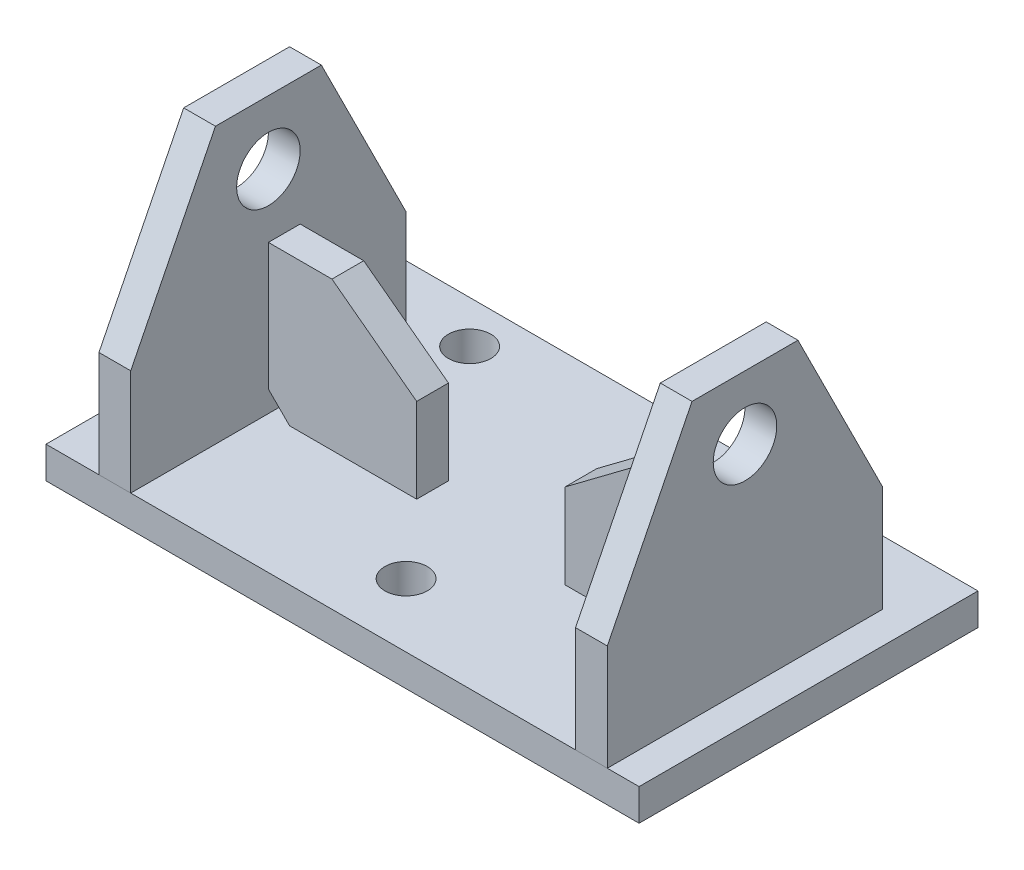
from build123d import *

# Parameters (mm, degrees)
SKETCH1_W      = 177.8
SKETCH1_H      = 101.6
PLATE_DEPTH    = 9.525
SKETCH2_R      = 6.35
HOLES_DEPTH    = 103.832755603
SKETCH3_R      = 9.525
EXTRUDE1_DEPTH = 9.525
EXTRUDE2_DEPTH = 9.525
CHAMFER1_SIZE  = 6.35


with BuildPart() as part:
    # Sketch1 → Plate (new body)
    with BuildSketch(Plane(origin=(0, 0, 0), x_dir=(1, 0, 0), z_dir=(0, 1, 0))):
        Rectangle(SKETCH1_W, SKETCH1_H)
    extrude(amount=PLATE_DEPTH)

    # Sketch2 → Holes (cut, through all)
    with BuildSketch(Plane(origin=(0, 9.525, 0), x_dir=(-1, 0, 0), z_dir=(0, 1, 0))):
        with Locations(Location((50.8, -38.1, 0), (0, 0, 90))):
            Circle(SKETCH2_R)
        with Locations(Location((-50.8, -38.1, 0), (0, 0, 90))):
            Circle(SKETCH2_R)
        with Locations(Location((0, 31.75, 0), (0, 0, 90))):
            Circle(SKETCH2_R)
    extrude(amount=-HOLES_DEPTH, mode=Mode.SUBTRACT)


with BuildPart() as body_2:
    # Sketch3 → Extrude1 (new body)
    with BuildSketch(Plane.ZY.offset(73.025)):
        Polygon((50.8, 9.525), (-31.75, 9.525), (-31.75, 41.275), (-6.35, 92.075), (25.4, 92.075), (50.8, 41.275), align=None)
        with Locations((9.525, 73.025)):
            Circle(SKETCH3_R, mode=Mode.SUBTRACT)
    extrude(amount=-EXTRUDE1_DEPTH)


with BuildPart() as body_3:
    # Sketch4 → Extrude2 (new body)
    with BuildSketch(Plane.XY.offset(9.525)):
        Polygon((-63.5, 9.525), (-19.05, 9.525), (-19.05, 34.925), (-44.45, 53.975), (-63.5, 53.975), align=None)
    extrude(amount=-EXTRUDE2_DEPTH)

    # Chamfer1
    chamfer1_edges = [body_3.edges().sort_by_distance(p)[0] for p in [
        (-63.5, 9.525, 4.7625),
    ]]
    chamfer(chamfer1_edges, length=CHAMFER1_SIZE)


with BuildPart() as body_4:
    # Mirror1: mirrored copy
    add(body_2.part.mirror(Plane(origin=(3.175, 0, 0), x_dir=(0, 0, 1), z_dir=(1, 0, 0))))


with BuildPart() as body_5:
    # Mirror1 2: mirrored copy
    add(body_3.part.mirror(Plane(origin=(3.175, 0, 0), x_dir=(0, 0, 1), z_dir=(1, 0, 0))))


solid = Compound([part.part, body_2.part, body_3.part, body_4.part, body_5.part])
